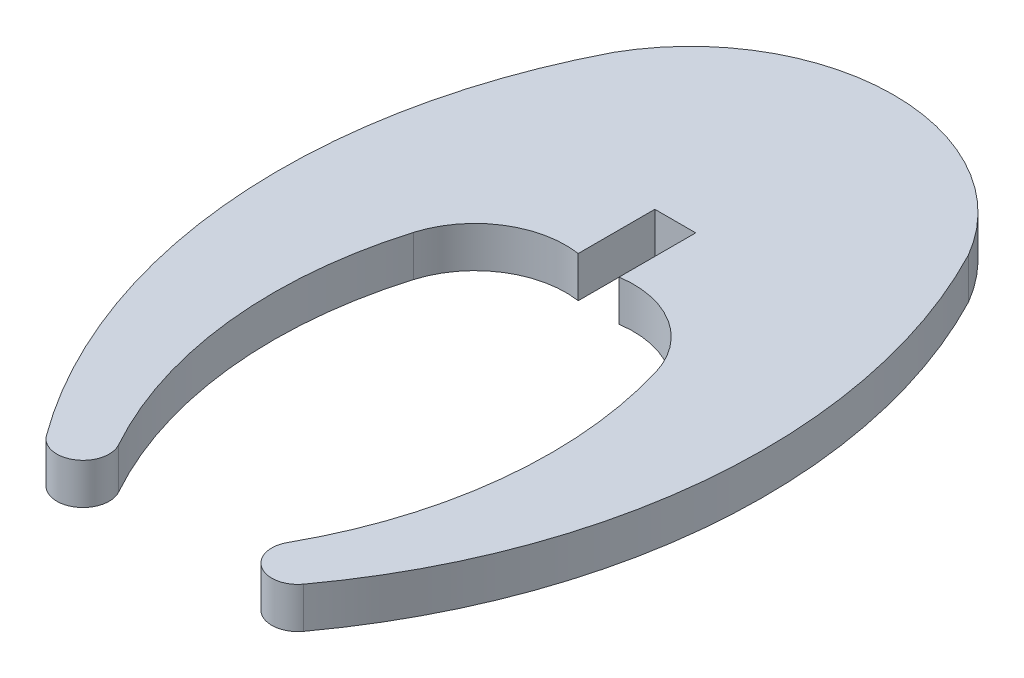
ISO-10303-21;
HEADER;
FILE_DESCRIPTION(('STEP AP214'),'2;1');
FILE_NAME('part.step','',(''),(''),'','','');
FILE_SCHEMA(('AUTOMOTIVE_DESIGN { 1 0 10303 214 1 1 1 1 }'));
ENDSEC;
DATA;
#1=APPLICATION_CONTEXT('core data for automotive mechanical design processes');
#2=APPLICATION_PROTOCOL_DEFINITION('international standard','automotive_design',2000,#1);
#3=PRODUCT_CONTEXT('',#1,'mechanical');
#4=PRODUCT('Part','Part','',(#3));
#5=PRODUCT_RELATED_PRODUCT_CATEGORY('part','',(#4));
#6=PRODUCT_DEFINITION_FORMATION('','',#4);
#7=PRODUCT_DEFINITION_CONTEXT('part definition',#1,'design');
#8=PRODUCT_DEFINITION('design','',#6,#7);
#9=PRODUCT_DEFINITION_SHAPE('','',#8);
#10=(LENGTH_UNIT() NAMED_UNIT(*) SI_UNIT(.MILLI.,.METRE.));
#11=(NAMED_UNIT(*) PLANE_ANGLE_UNIT() SI_UNIT($,.RADIAN.));
#12=(NAMED_UNIT(*) SI_UNIT($,.STERADIAN.) SOLID_ANGLE_UNIT());
#13=UNCERTAINTY_MEASURE_WITH_UNIT(LENGTH_MEASURE(1.E-05),#10,'distance_accuracy_value','');
#14=(GEOMETRIC_REPRESENTATION_CONTEXT(3) GLOBAL_UNCERTAINTY_ASSIGNED_CONTEXT((#13)) GLOBAL_UNIT_ASSIGNED_CONTEXT((#10,
#11,#12)) REPRESENTATION_CONTEXT('',''));
#15=CARTESIAN_POINT('',(0.,0.,0.));
#16=DIRECTION('',(0.,0.,1.));
#17=DIRECTION('',(1.,0.,0.));
#18=AXIS2_PLACEMENT_3D('',#15,#16,#17);
#19=CARTESIAN_POINT('',(-42020.7050947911,3.,-18314.3835108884));
#20=DIRECTION('',(0.,-1.,0.));
#21=DIRECTION('',(0.,0.,-1.));
#22=AXIS2_PLACEMENT_3D('',#19,#20,#21);
#23=CYLINDRICAL_SURFACE('',#22,6.67415036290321);
#24=CARTESIAN_POINT('',(-42020.7050947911,0.,-18314.3835108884));
#25=DIRECTION('',(0.,-1.,0.));
#26=DIRECTION('',(0.,0.,1.));
#27=AXIS2_PLACEMENT_3D('',#24,#25,#26);
#28=CIRCLE('',#27,6.67415036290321);
#29=CARTESIAN_POINT('',(-42027.104185,0.,-18316.279804));
#30=VERTEX_POINT('',#29);
#31=CARTESIAN_POINT('',(-42019.71875,0.,-18320.984375));
#32=VERTEX_POINT('',#31);
#33=EDGE_CURVE('E156',#30,#32,#28,.T.);
#34=ORIENTED_EDGE('',*,*,#33,.T.);
#35=DIRECTION('',(0.,-1.,0.));
#36=VECTOR('',#35,1.);
#37=CARTESIAN_POINT('',(-42019.71875,3.,-18320.984375));
#38=LINE('',#37,#36);
#39=CARTESIAN_POINT('',(-42019.71875,3.,-18320.984375));
#40=VERTEX_POINT('',#39);
#41=EDGE_CURVE('E11',#40,#32,#38,.T.);
#42=ORIENTED_EDGE('',*,*,#41,.F.);
#43=CARTESIAN_POINT('',(-42020.7050947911,3.,-18314.3835108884));
#44=DIRECTION('',(0.,-1.,0.));
#45=DIRECTION('',(0.,0.,1.));
#46=AXIS2_PLACEMENT_3D('',#43,#44,#45);
#47=CIRCLE('',#46,6.67415036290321);
#48=CARTESIAN_POINT('',(-42027.104185,3.,-18316.279804));
#49=VERTEX_POINT('',#48);
#50=EDGE_CURVE('E178',#49,#40,#47,.T.);
#51=ORIENTED_EDGE('',*,*,#50,.F.);
#52=DIRECTION('',(0.,-1.,0.));
#53=VECTOR('',#52,1.);
#54=CARTESIAN_POINT('',(-42027.104185,3.,-18316.279804));
#55=LINE('',#54,#53);
#56=EDGE_CURVE('E152',#49,#30,#55,.T.);
#57=ORIENTED_EDGE('',*,*,#56,.T.);
#58=EDGE_LOOP('',(#34,#42,#51,#57));
#59=FACE_BOUND('',#58,.T.);
#60=ADVANCED_FACE('F36',(#59),#23,.F.);
#61=CARTESIAN_POINT('',(-42019.71875,3.,-18320.984375));
#62=DIRECTION('',(-1.,0.,0.));
#63=DIRECTION('',(0.,0.,1.));
#64=AXIS2_PLACEMENT_3D('',#61,#62,#63);
#65=PLANE('',#64);
#66=DIRECTION('',(0.,0.,-1.));
#67=VECTOR('',#66,1.);
#68=CARTESIAN_POINT('',(-42019.71875,0.,-18320.984375));
#69=LINE('',#68,#67);
#70=CARTESIAN_POINT('',(-42019.71875,0.,-18326.601562));
#71=VERTEX_POINT('',#70);
#72=EDGE_CURVE('E159',#32,#71,#69,.T.);
#73=ORIENTED_EDGE('',*,*,#72,.T.);
#74=DIRECTION('',(0.,-1.,0.));
#75=VECTOR('',#74,1.);
#76=CARTESIAN_POINT('',(-42019.71875,3.,-18326.601562));
#77=LINE('',#76,#75);
#78=CARTESIAN_POINT('',(-42019.71875,3.,-18326.601562));
#79=VERTEX_POINT('',#78);
#80=EDGE_CURVE('E44',#79,#71,#77,.T.);
#81=ORIENTED_EDGE('',*,*,#80,.F.);
#82=DIRECTION('',(0.,0.,-1.));
#83=VECTOR('',#82,1.);
#84=CARTESIAN_POINT('',(-42019.71875,3.,-18320.984375));
#85=LINE('',#84,#83);
#86=EDGE_CURVE('E107',#40,#79,#85,.T.);
#87=ORIENTED_EDGE('',*,*,#86,.F.);
#88=ORIENTED_EDGE('',*,*,#41,.T.);
#89=EDGE_LOOP('',(#73,#81,#87,#88));
#90=FACE_BOUND('',#89,.T.);
#91=ADVANCED_FACE('F256',(#90),#65,.F.);
#92=CARTESIAN_POINT('',(-42019.71875,3.,-18326.601562));
#93=DIRECTION('',(0.,0.,-1.));
#94=DIRECTION('',(-1.,0.,0.));
#95=AXIS2_PLACEMENT_3D('',#92,#93,#94);
#96=PLANE('',#95);
#97=DIRECTION('',(1.,0.,0.));
#98=VECTOR('',#97,1.);
#99=CARTESIAN_POINT('',(-42019.71875,0.,-18326.601562));
#100=LINE('',#99,#98);
#101=CARTESIAN_POINT('',(-42016.722656,0.,-18326.601562));
#102=VERTEX_POINT('',#101);
#103=EDGE_CURVE('E161',#71,#102,#100,.T.);
#104=ORIENTED_EDGE('',*,*,#103,.T.);
#105=DIRECTION('',(0.,-1.,0.));
#106=VECTOR('',#105,1.);
#107=CARTESIAN_POINT('',(-42016.722656,3.,-18326.601562));
#108=LINE('',#107,#106);
#109=CARTESIAN_POINT('',(-42016.722656,3.,-18326.601562));
#110=VERTEX_POINT('',#109);
#111=EDGE_CURVE('E197',#110,#102,#108,.T.);
#112=ORIENTED_EDGE('',*,*,#111,.F.);
#113=DIRECTION('',(1.,0.,0.));
#114=VECTOR('',#113,1.);
#115=CARTESIAN_POINT('',(-42019.71875,3.,-18326.601562));
#116=LINE('',#115,#114);
#117=EDGE_CURVE('E205',#79,#110,#116,.T.);
#118=ORIENTED_EDGE('',*,*,#117,.F.);
#119=ORIENTED_EDGE('',*,*,#80,.T.);
#120=EDGE_LOOP('',(#104,#112,#118,#119));
#121=FACE_BOUND('',#120,.T.);
#122=ADVANCED_FACE('F203',(#121),#96,.F.);
#123=CARTESIAN_POINT('',(-42016.722656,3.,-18326.601562));
#124=DIRECTION('',(1.,0.,-6.32692008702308E-12));
#125=DIRECTION('',(-6.32692008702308E-12,0.,-1.));
#126=AXIS2_PLACEMENT_3D('',#123,#124,#125);
#127=PLANE('',#126);
#128=DIRECTION('',(6.32692008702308E-12,0.,1.));
#129=VECTOR('',#128,1.);
#130=CARTESIAN_POINT('',(-42016.722656,0.,-18326.601562));
#131=LINE('',#130,#129);
#132=CARTESIAN_POINT('',(-42016.722656,0.,-18320.986328));
#133=VERTEX_POINT('',#132);
#134=EDGE_CURVE('E163',#102,#133,#131,.T.);
#135=ORIENTED_EDGE('',*,*,#134,.T.);
#136=DIRECTION('',(0.,-1.,0.));
#137=VECTOR('',#136,1.);
#138=CARTESIAN_POINT('',(-42016.722656,3.,-18320.986328));
#139=LINE('',#138,#137);
#140=CARTESIAN_POINT('',(-42016.722656,3.,-18320.986328));
#141=VERTEX_POINT('',#140);
#142=EDGE_CURVE('E194',#141,#133,#139,.T.);
#143=ORIENTED_EDGE('',*,*,#142,.F.);
#144=DIRECTION('',(6.32692008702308E-12,0.,1.));
#145=VECTOR('',#144,1.);
#146=CARTESIAN_POINT('',(-42016.722656,3.,-18326.601562));
#147=LINE('',#146,#145);
#148=EDGE_CURVE('E223',#110,#141,#147,.T.);
#149=ORIENTED_EDGE('',*,*,#148,.F.);
#150=ORIENTED_EDGE('',*,*,#111,.T.);
#151=EDGE_LOOP('',(#135,#143,#149,#150));
#152=FACE_BOUND('',#151,.T.);
#153=ADVANCED_FACE('F214',(#152),#127,.F.);
#154=CARTESIAN_POINT('',(-42015.7380765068,3.,-18314.3865887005));
#155=DIRECTION('',(0.,-1.,0.));
#156=DIRECTION('',(0.,0.,-1.));
#157=AXIS2_PLACEMENT_3D('',#154,#155,#156);
#158=CYLINDRICAL_SURFACE('',#157,6.67277720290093);
#159=CARTESIAN_POINT('',(-42015.7380765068,0.,-18314.3865887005));
#160=DIRECTION('',(0.,-1.,0.));
#161=DIRECTION('',(0.,0.,1.));
#162=AXIS2_PLACEMENT_3D('',#159,#160,#161);
#163=CIRCLE('',#162,6.67277720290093);
#164=CARTESIAN_POINT('',(-42009.340276,0.,-18316.282401));
#165=VERTEX_POINT('',#164);
#166=EDGE_CURVE('E165',#133,#165,#163,.T.);
#167=ORIENTED_EDGE('',*,*,#166,.T.);
#168=DIRECTION('',(0.,-1.,0.));
#169=VECTOR('',#168,1.);
#170=CARTESIAN_POINT('',(-42009.340276,3.,-18316.282401));
#171=LINE('',#170,#169);
#172=CARTESIAN_POINT('',(-42009.340276,3.,-18316.282401));
#173=VERTEX_POINT('',#172);
#174=EDGE_CURVE('E191',#173,#165,#171,.T.);
#175=ORIENTED_EDGE('',*,*,#174,.F.);
#176=CARTESIAN_POINT('',(-42015.7380765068,3.,-18314.3865887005));
#177=DIRECTION('',(0.,-1.,0.));
#178=DIRECTION('',(0.,0.,1.));
#179=AXIS2_PLACEMENT_3D('',#176,#177,#178);
#180=CIRCLE('',#179,6.67277720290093);
#181=EDGE_CURVE('E220',#141,#173,#180,.T.);
#182=ORIENTED_EDGE('',*,*,#181,.F.);
#183=ORIENTED_EDGE('',*,*,#142,.T.);
#184=EDGE_LOOP('',(#167,#175,#182,#183));
#185=FACE_BOUND('',#184,.T.);
#186=ADVANCED_FACE('F218',(#185),#158,.F.);
#187=CARTESIAN_POINT('',(-42039.5901535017,3.,-18307.3175005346));
#188=DIRECTION('',(0.,-1.,0.));
#189=DIRECTION('',(0.,0.,-1.));
#190=AXIS2_PLACEMENT_3D('',#187,#188,#189);
#191=CYLINDRICAL_SURFACE('',#190,31.5503491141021);
#192=CARTESIAN_POINT('',(-42039.5901535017,0.,-18307.3175005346));
#193=DIRECTION('',(0.,-1.,0.));
#194=DIRECTION('',(0.,0.,1.));
#195=AXIS2_PLACEMENT_3D('',#192,#193,#194);
#196=CIRCLE('',#195,31.5503491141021);
#197=CARTESIAN_POINT('',(-42012.014861,0.,-18291.9868850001));
#198=VERTEX_POINT('',#197);
#199=EDGE_CURVE('E167',#165,#198,#196,.T.);
#200=ORIENTED_EDGE('',*,*,#199,.T.);
#201=DIRECTION('',(0.,-1.,0.));
#202=VECTOR('',#201,1.);
#203=CARTESIAN_POINT('',(-42012.014861,3.,-18291.9868850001));
#204=LINE('',#203,#202);
#205=CARTESIAN_POINT('',(-42012.014861,3.,-18291.9868850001));
#206=VERTEX_POINT('',#205);
#207=EDGE_CURVE('E188',#206,#198,#204,.T.);
#208=ORIENTED_EDGE('',*,*,#207,.F.);
#209=CARTESIAN_POINT('',(-42039.5901535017,3.,-18307.3175005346));
#210=DIRECTION('',(0.,-1.,0.));
#211=DIRECTION('',(0.,0.,1.));
#212=AXIS2_PLACEMENT_3D('',#209,#210,#211);
#213=CIRCLE('',#212,31.5503491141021);
#214=EDGE_CURVE('E222',#173,#206,#213,.T.);
#215=ORIENTED_EDGE('',*,*,#214,.F.);
#216=ORIENTED_EDGE('',*,*,#174,.T.);
#217=EDGE_LOOP('',(#200,#208,#215,#216));
#218=FACE_BOUND('',#217,.T.);
#219=ADVANCED_FACE('F269',(#218),#191,.F.);
#220=CARTESIAN_POINT('',(-42010.3400105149,3.,-18291.050888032));
#221=DIRECTION('',(0.,-1.,0.));
#222=DIRECTION('',(0.,0.,-1.));
#223=AXIS2_PLACEMENT_3D('',#220,#221,#222);
#224=CYLINDRICAL_SURFACE('',#223,1.91864912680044);
#225=CARTESIAN_POINT('',(-42010.3400105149,0.,-18291.050888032));
#226=DIRECTION('',(0.,1.,0.));
#227=DIRECTION('',(0.,0.,1.));
#228=AXIS2_PLACEMENT_3D('',#225,#226,#227);
#229=CIRCLE('',#228,1.91864912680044);
#230=CARTESIAN_POINT('',(-42008.793025,0.,-18289.915965));
#231=VERTEX_POINT('',#230);
#232=EDGE_CURVE('E169',#198,#231,#229,.T.);
#233=ORIENTED_EDGE('',*,*,#232,.T.);
#234=DIRECTION('',(0.,-1.,0.));
#235=VECTOR('',#234,1.);
#236=CARTESIAN_POINT('',(-42008.793025,3.,-18289.915965));
#237=LINE('',#236,#235);
#238=CARTESIAN_POINT('',(-42008.793025,3.,-18289.915965));
#239=VERTEX_POINT('',#238);
#240=EDGE_CURVE('E185',#239,#231,#237,.T.);
#241=ORIENTED_EDGE('',*,*,#240,.F.);
#242=CARTESIAN_POINT('',(-42010.3400105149,3.,-18291.050888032));
#243=DIRECTION('',(0.,1.,0.));
#244=DIRECTION('',(0.,0.,1.));
#245=AXIS2_PLACEMENT_3D('',#242,#243,#244);
#246=CIRCLE('',#245,1.91864912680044);
#247=EDGE_CURVE('E225',#206,#239,#246,.T.);
#248=ORIENTED_EDGE('',*,*,#247,.F.);
#249=ORIENTED_EDGE('',*,*,#207,.T.);
#250=EDGE_LOOP('',(#233,#241,#248,#249));
#251=FACE_BOUND('',#250,.T.);
#252=ADVANCED_FACE('F272',(#251),#224,.T.);
#253=CARTESIAN_POINT('',(-42043.4335365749,3.,-18315.3464519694));
#254=DIRECTION('',(0.,-1.,0.));
#255=DIRECTION('',(0.,0.,-1.));
#256=AXIS2_PLACEMENT_3D('',#253,#254,#255);
#257=CYLINDRICAL_SURFACE('',#256,42.9729532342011);
#258=CARTESIAN_POINT('',(-42043.4335365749,0.,-18315.3464519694));
#259=DIRECTION('',(0.,1.,0.));
#260=DIRECTION('',(0.,0.,1.));
#261=AXIS2_PLACEMENT_3D('',#258,#259,#260);
#262=CIRCLE('',#261,42.9729532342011);
#263=CARTESIAN_POINT('',(-42005.321092,0.,-18335.198814));
#264=VERTEX_POINT('',#263);
#265=EDGE_CURVE('E171',#231,#264,#262,.T.);
#266=ORIENTED_EDGE('',*,*,#265,.T.);
#267=DIRECTION('',(0.,-1.,0.));
#268=VECTOR('',#267,1.);
#269=CARTESIAN_POINT('',(-42005.321092,3.,-18335.198814));
#270=LINE('',#269,#268);
#271=CARTESIAN_POINT('',(-42005.321092,3.,-18335.198814));
#272=VERTEX_POINT('',#271);
#273=EDGE_CURVE('E182',#272,#264,#270,.T.);
#274=ORIENTED_EDGE('',*,*,#273,.F.);
#275=CARTESIAN_POINT('',(-42043.4335365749,3.,-18315.3464519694));
#276=DIRECTION('',(0.,1.,0.));
#277=DIRECTION('',(0.,0.,1.));
#278=AXIS2_PLACEMENT_3D('',#275,#276,#277);
#279=CIRCLE('',#278,42.9729532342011);
#280=EDGE_CURVE('E231',#239,#272,#279,.T.);
#281=ORIENTED_EDGE('',*,*,#280,.F.);
#282=ORIENTED_EDGE('',*,*,#240,.T.);
#283=EDGE_LOOP('',(#266,#274,#281,#282));
#284=FACE_BOUND('',#283,.T.);
#285=ADVANCED_FACE('F237',(#284),#257,.T.);
#286=CARTESIAN_POINT('',(-42018.2174311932,3.,-18327.7070382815));
#287=DIRECTION('',(0.,-1.,0.));
#288=DIRECTION('',(0.,0.,-1.));
#289=AXIS2_PLACEMENT_3D('',#286,#287,#288);
#290=CYLINDRICAL_SURFACE('',#289,14.9144985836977);
#291=CARTESIAN_POINT('',(-42018.2174311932,0.,-18327.7070382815));
#292=DIRECTION('',(0.,1.,0.));
#293=DIRECTION('',(0.,0.,1.));
#294=AXIS2_PLACEMENT_3D('',#291,#292,#293);
#295=CIRCLE('',#294,14.9144985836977);
#296=CARTESIAN_POINT('',(-42031.1956930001,0.,-18335.055983));
#297=VERTEX_POINT('',#296);
#298=EDGE_CURVE('E173',#264,#297,#295,.T.);
#299=ORIENTED_EDGE('',*,*,#298,.T.);
#300=DIRECTION('',(0.,-1.,0.));
#301=VECTOR('',#300,1.);
#302=CARTESIAN_POINT('',(-42031.1956930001,3.,-18335.055983));
#303=LINE('',#302,#301);
#304=CARTESIAN_POINT('',(-42031.1956930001,3.,-18335.055983));
#305=VERTEX_POINT('',#304);
#306=EDGE_CURVE('E147',#305,#297,#303,.T.);
#307=ORIENTED_EDGE('',*,*,#306,.F.);
#308=CARTESIAN_POINT('',(-42018.2174311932,3.,-18327.7070382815));
#309=DIRECTION('',(0.,1.,0.));
#310=DIRECTION('',(0.,0.,1.));
#311=AXIS2_PLACEMENT_3D('',#308,#309,#310);
#312=CIRCLE('',#311,14.9144985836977);
#313=EDGE_CURVE('E138',#272,#305,#312,.T.);
#314=ORIENTED_EDGE('',*,*,#313,.F.);
#315=ORIENTED_EDGE('',*,*,#273,.T.);
#316=EDGE_LOOP('',(#299,#307,#314,#315));
#317=FACE_BOUND('',#316,.T.);
#318=ADVANCED_FACE('F241',(#317),#290,.T.);
#319=CARTESIAN_POINT('',(-41993.0077657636,3.,-18315.3490206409));
#320=DIRECTION('',(0.,-1.,0.));
#321=DIRECTION('',(0.,0.,-1.));
#322=AXIS2_PLACEMENT_3D('',#319,#320,#321);
#323=CYLINDRICAL_SURFACE('',#322,42.9730398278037);
#324=CARTESIAN_POINT('',(-41993.0077657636,0.,-18315.3490206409));
#325=DIRECTION('',(0.,1.,0.));
#326=DIRECTION('',(0.,0.,1.));
#327=AXIS2_PLACEMENT_3D('',#324,#325,#326);
#328=CIRCLE('',#327,42.9730398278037);
#329=CARTESIAN_POINT('',(-42027.6485700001,0.,-18289.918786));
#330=VERTEX_POINT('',#329);
#331=EDGE_CURVE('E146',#297,#330,#328,.T.);
#332=ORIENTED_EDGE('',*,*,#331,.T.);
#333=DIRECTION('',(0.,-1.,0.));
#334=VECTOR('',#333,1.);
#335=CARTESIAN_POINT('',(-42027.6485700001,3.,-18289.918786));
#336=LINE('',#335,#334);
#337=CARTESIAN_POINT('',(-42027.6485700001,3.,-18289.918786));
#338=VERTEX_POINT('',#337);
#339=EDGE_CURVE('E143',#338,#330,#336,.T.);
#340=ORIENTED_EDGE('',*,*,#339,.F.);
#341=CARTESIAN_POINT('',(-41993.0077657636,3.,-18315.3490206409));
#342=DIRECTION('',(0.,1.,0.));
#343=DIRECTION('',(0.,0.,1.));
#344=AXIS2_PLACEMENT_3D('',#341,#342,#343);
#345=CIRCLE('',#344,42.9730398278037);
#346=EDGE_CURVE('E132',#305,#338,#345,.T.);
#347=ORIENTED_EDGE('',*,*,#346,.F.);
#348=ORIENTED_EDGE('',*,*,#306,.T.);
#349=EDGE_LOOP('',(#332,#340,#347,#348));
#350=FACE_BOUND('',#349,.T.);
#351=ADVANCED_FACE('F144',(#350),#323,.T.);
#352=CARTESIAN_POINT('',(-42026.0988334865,3.,-18291.0519798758));
#353=DIRECTION('',(0.,-1.,0.));
#354=DIRECTION('',(0.,0.,-1.));
#355=AXIS2_PLACEMENT_3D('',#352,#353,#354);
#356=CYLINDRICAL_SURFACE('',#355,1.91984677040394);
#357=CARTESIAN_POINT('',(-42026.0988334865,0.,-18291.0519798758));
#358=DIRECTION('',(0.,1.,0.));
#359=DIRECTION('',(0.,0.,1.));
#360=AXIS2_PLACEMENT_3D('',#357,#358,#359);
#361=CIRCLE('',#360,1.91984677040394);
#362=CARTESIAN_POINT('',(-42024.421329,0.,-18291.985677));
#363=VERTEX_POINT('',#362);
#364=EDGE_CURVE('E93',#330,#363,#361,.T.);
#365=ORIENTED_EDGE('',*,*,#364,.T.);
#366=DIRECTION('',(0.,-1.,0.));
#367=VECTOR('',#366,1.);
#368=CARTESIAN_POINT('',(-42024.421329,3.,-18291.985677));
#369=LINE('',#368,#367);
#370=CARTESIAN_POINT('',(-42024.421329,3.,-18291.985677));
#371=VERTEX_POINT('',#370);
#372=EDGE_CURVE('E148',#371,#363,#369,.T.);
#373=ORIENTED_EDGE('',*,*,#372,.F.);
#374=CARTESIAN_POINT('',(-42026.0988334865,3.,-18291.0519798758));
#375=DIRECTION('',(0.,1.,0.));
#376=DIRECTION('',(0.,0.,1.));
#377=AXIS2_PLACEMENT_3D('',#374,#375,#376);
#378=CIRCLE('',#377,1.91984677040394);
#379=EDGE_CURVE('E136',#338,#371,#378,.T.);
#380=ORIENTED_EDGE('',*,*,#379,.F.);
#381=ORIENTED_EDGE('',*,*,#339,.T.);
#382=EDGE_LOOP('',(#365,#373,#380,#381));
#383=FACE_BOUND('',#382,.T.);
#384=ADVANCED_FACE('F150',(#383),#356,.T.);
#385=CARTESIAN_POINT('',(-41996.8521247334,3.,-18307.3254077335));
#386=DIRECTION('',(0.,-1.,0.));
#387=DIRECTION('',(0.,0.,-1.));
#388=AXIS2_PLACEMENT_3D('',#385,#386,#387);
#389=CYLINDRICAL_SURFACE('',#388,31.5494589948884);
#390=CARTESIAN_POINT('',(-41996.8521247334,0.,-18307.3254077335));
#391=DIRECTION('',(0.,-1.,0.));
#392=DIRECTION('',(0.,0.,1.));
#393=AXIS2_PLACEMENT_3D('',#390,#391,#392);
#394=CIRCLE('',#393,31.5494589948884);
#395=EDGE_CURVE('E99',#363,#30,#394,.T.);
#396=ORIENTED_EDGE('',*,*,#395,.T.);
#397=ORIENTED_EDGE('',*,*,#56,.F.);
#398=CARTESIAN_POINT('',(-41996.8521247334,3.,-18307.3254077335));
#399=DIRECTION('',(0.,-1.,0.));
#400=DIRECTION('',(0.,0.,1.));
#401=AXIS2_PLACEMENT_3D('',#398,#399,#400);
#402=CIRCLE('',#401,31.5494589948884);
#403=EDGE_CURVE('E52',#371,#49,#402,.T.);
#404=ORIENTED_EDGE('',*,*,#403,.F.);
#405=ORIENTED_EDGE('',*,*,#372,.T.);
#406=EDGE_LOOP('',(#396,#397,#404,#405));
#407=FACE_BOUND('',#406,.T.);
#408=ADVANCED_FACE('F245',(#407),#389,.F.);
#409=CARTESIAN_POINT('',(-42020.7050947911,3.,-18314.3835108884));
#410=DIRECTION('',(0.,1.,0.));
#411=DIRECTION('',(0.,0.,1.));
#412=AXIS2_PLACEMENT_3D('',#409,#410,#411);
#413=PLANE('',#412);
#414=ORIENTED_EDGE('',*,*,#50,.T.);
#415=ORIENTED_EDGE('',*,*,#86,.T.);
#416=ORIENTED_EDGE('',*,*,#117,.T.);
#417=ORIENTED_EDGE('',*,*,#148,.T.);
#418=ORIENTED_EDGE('',*,*,#181,.T.);
#419=ORIENTED_EDGE('',*,*,#214,.T.);
#420=ORIENTED_EDGE('',*,*,#247,.T.);
#421=ORIENTED_EDGE('',*,*,#280,.T.);
#422=ORIENTED_EDGE('',*,*,#313,.T.);
#423=ORIENTED_EDGE('',*,*,#346,.T.);
#424=ORIENTED_EDGE('',*,*,#379,.T.);
#425=ORIENTED_EDGE('',*,*,#403,.T.);
#426=EDGE_LOOP('',(#414,#415,#416,#417,#418,#419,#420,#421,#422,#423,#424,#425));
#427=FACE_BOUND('',#426,.T.);
#428=ADVANCED_FACE('F134',(#427),#413,.T.);
#429=CARTESIAN_POINT('',(-42020.7050947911,0.,-18314.3835108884));
#430=DIRECTION('',(0.,1.,0.));
#431=DIRECTION('',(0.,0.,1.));
#432=AXIS2_PLACEMENT_3D('',#429,#430,#431);
#433=PLANE('',#432);
#434=ORIENTED_EDGE('',*,*,#33,.F.);
#435=ORIENTED_EDGE('',*,*,#395,.F.);
#436=ORIENTED_EDGE('',*,*,#364,.F.);
#437=ORIENTED_EDGE('',*,*,#331,.F.);
#438=ORIENTED_EDGE('',*,*,#298,.F.);
#439=ORIENTED_EDGE('',*,*,#265,.F.);
#440=ORIENTED_EDGE('',*,*,#232,.F.);
#441=ORIENTED_EDGE('',*,*,#199,.F.);
#442=ORIENTED_EDGE('',*,*,#166,.F.);
#443=ORIENTED_EDGE('',*,*,#134,.F.);
#444=ORIENTED_EDGE('',*,*,#103,.F.);
#445=ORIENTED_EDGE('',*,*,#72,.F.);
#446=EDGE_LOOP('',(#434,#435,#436,#437,#438,#439,#440,#441,#442,#443,#444,#445));
#447=FACE_BOUND('',#446,.T.);
#448=ADVANCED_FACE('F209',(#447),#433,.F.);
#449=CLOSED_SHELL('',(#60,#91,#122,#153,#186,#219,#252,#285,#318,#351,#384,#408,#428,#448));
#450=MANIFOLD_SOLID_BREP('B2',#449);
#451=ADVANCED_BREP_SHAPE_REPRESENTATION('',(#18,#450),#14);
#452=SHAPE_DEFINITION_REPRESENTATION(#9,#451);
ENDSEC;
END-ISO-10303-21;
